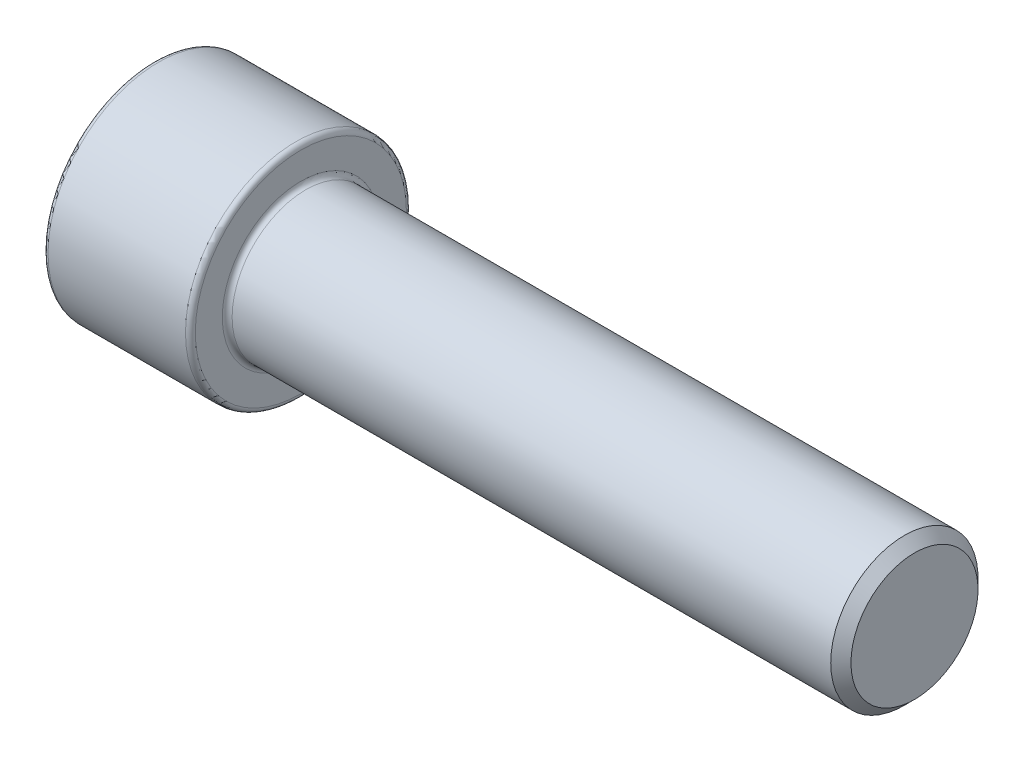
ISO-10303-21;
HEADER;
FILE_DESCRIPTION(('STEP AP214'),'2;1');
FILE_NAME('part.step','',(''),(''),'','','');
FILE_SCHEMA(('AUTOMOTIVE_DESIGN { 1 0 10303 214 1 1 1 1 }'));
ENDSEC;
DATA;
#1=APPLICATION_CONTEXT('core data for automotive mechanical design processes');
#2=APPLICATION_PROTOCOL_DEFINITION('international standard','automotive_design',2000,#1);
#3=PRODUCT_CONTEXT('',#1,'mechanical');
#4=PRODUCT('Part','Part','',(#3));
#5=PRODUCT_RELATED_PRODUCT_CATEGORY('part','',(#4));
#6=PRODUCT_DEFINITION_FORMATION('','',#4);
#7=PRODUCT_DEFINITION_CONTEXT('part definition',#1,'design');
#8=PRODUCT_DEFINITION('design','',#6,#7);
#9=PRODUCT_DEFINITION_SHAPE('','',#8);
#10=(LENGTH_UNIT() NAMED_UNIT(*) SI_UNIT(.MILLI.,.METRE.));
#11=(NAMED_UNIT(*) PLANE_ANGLE_UNIT() SI_UNIT($,.RADIAN.));
#12=(NAMED_UNIT(*) SI_UNIT($,.STERADIAN.) SOLID_ANGLE_UNIT());
#13=UNCERTAINTY_MEASURE_WITH_UNIT(LENGTH_MEASURE(1.E-05),#10,'distance_accuracy_value','');
#14=(GEOMETRIC_REPRESENTATION_CONTEXT(3) GLOBAL_UNCERTAINTY_ASSIGNED_CONTEXT((#13)) GLOBAL_UNIT_ASSIGNED_CONTEXT((#10,
#11,#12)) REPRESENTATION_CONTEXT('',''));
#15=CARTESIAN_POINT('',(0.,0.,0.));
#16=DIRECTION('',(0.,0.,1.));
#17=DIRECTION('',(1.,0.,0.));
#18=AXIS2_PLACEMENT_3D('',#15,#16,#17);
#19=CARTESIAN_POINT('',(12.,10.9696551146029,0.));
#20=DIRECTION('',(1.,0.,0.));
#21=DIRECTION('',(0.,0.,-1.));
#22=AXIS2_PLACEMENT_3D('',#19,#20,#21);
#23=PLANE('',#22);
#24=CARTESIAN_POINT('',(12.,0.,0.));
#25=DIRECTION('',(1.,0.,0.));
#26=DIRECTION('',(0.,0.,-1.));
#27=AXIS2_PLACEMENT_3D('',#24,#25,#26);
#28=CIRCLE('',#27,9.5);
#29=CARTESIAN_POINT('',(12.,0.,-9.5));
#30=VERTEX_POINT('',#29);
#31=CARTESIAN_POINT('',(12.,-8.22724133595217,-4.75));
#32=VERTEX_POINT('',#31);
#33=EDGE_CURVE('E171',#30,#32,#28,.F.);
#34=ORIENTED_EDGE('',*,*,#33,.F.);
#35=DIRECTION('',(0.,1.,0.));
#36=VECTOR('',#35,1.);
#37=CARTESIAN_POINT('',(12.,-5.48482755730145,-9.5));
#38=LINE('',#37,#36);
#39=CARTESIAN_POINT('',(12.,-5.48482755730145,-9.5));
#40=VERTEX_POINT('',#39);
#41=EDGE_CURVE('E204',#40,#30,#38,.T.);
#42=ORIENTED_EDGE('',*,*,#41,.F.);
#43=DIRECTION('',(0.,0.5,-0.866025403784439));
#44=VECTOR('',#43,1.);
#45=CARTESIAN_POINT('',(12.,-10.9696551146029,0.));
#46=LINE('',#45,#44);
#47=EDGE_CURVE('E196',#32,#40,#46,.T.);
#48=ORIENTED_EDGE('',*,*,#47,.F.);
#49=EDGE_LOOP('',(#34,#42,#48));
#50=FACE_BOUND('',#49,.T.);
#51=ADVANCED_FACE('F44',(#50),#23,.F.);
#52=CARTESIAN_POINT('',(12.,-8.22724133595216,4.75));
#53=VERTEX_POINT('',#52);
#54=EDGE_CURVE('E299',#32,#53,#28,.F.);
#55=ORIENTED_EDGE('',*,*,#54,.F.);
#56=CARTESIAN_POINT('',(12.,-10.9696551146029,0.));
#57=VERTEX_POINT('',#56);
#58=EDGE_CURVE('E197',#57,#32,#46,.T.);
#59=ORIENTED_EDGE('',*,*,#58,.F.);
#60=DIRECTION('',(0.,-0.5,-0.866025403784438));
#61=VECTOR('',#60,1.);
#62=CARTESIAN_POINT('',(12.,-5.48482755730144,9.5));
#63=LINE('',#62,#61);
#64=EDGE_CURVE('E191',#53,#57,#63,.T.);
#65=ORIENTED_EDGE('',*,*,#64,.F.);
#66=EDGE_LOOP('',(#55,#59,#65));
#67=FACE_BOUND('',#66,.T.);
#68=ADVANCED_FACE('F139',(#67),#23,.F.);
#69=CARTESIAN_POINT('',(12.,0.,9.5));
#70=VERTEX_POINT('',#69);
#71=EDGE_CURVE('E297',#53,#70,#28,.F.);
#72=ORIENTED_EDGE('',*,*,#71,.F.);
#73=CARTESIAN_POINT('',(12.,-5.48482755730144,9.5));
#74=VERTEX_POINT('',#73);
#75=EDGE_CURVE('E193',#74,#53,#63,.T.);
#76=ORIENTED_EDGE('',*,*,#75,.F.);
#77=DIRECTION('',(0.,-1.,0.));
#78=VECTOR('',#77,1.);
#79=CARTESIAN_POINT('',(12.,5.48482755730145,9.5));
#80=LINE('',#79,#78);
#81=EDGE_CURVE('E188',#70,#74,#80,.T.);
#82=ORIENTED_EDGE('',*,*,#81,.F.);
#83=EDGE_LOOP('',(#72,#76,#82));
#84=FACE_BOUND('',#83,.T.);
#85=ADVANCED_FACE('F144',(#84),#23,.F.);
#86=CARTESIAN_POINT('',(12.,8.22724133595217,4.75));
#87=VERTEX_POINT('',#86);
#88=EDGE_CURVE('E305',#70,#87,#28,.F.);
#89=ORIENTED_EDGE('',*,*,#88,.F.);
#90=CARTESIAN_POINT('',(12.,5.48482755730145,9.5));
#91=VERTEX_POINT('',#90);
#92=EDGE_CURVE('E192',#91,#70,#80,.T.);
#93=ORIENTED_EDGE('',*,*,#92,.F.);
#94=DIRECTION('',(0.,-0.5,0.866025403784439));
#95=VECTOR('',#94,1.);
#96=CARTESIAN_POINT('',(12.,10.9696551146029,0.));
#97=LINE('',#96,#95);
#98=EDGE_CURVE('E184',#87,#91,#97,.T.);
#99=ORIENTED_EDGE('',*,*,#98,.F.);
#100=EDGE_LOOP('',(#89,#93,#99));
#101=FACE_BOUND('',#100,.T.);
#102=ADVANCED_FACE('F156',(#101),#23,.F.);
#103=CARTESIAN_POINT('',(12.,8.22724133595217,-4.75));
#104=VERTEX_POINT('',#103);
#105=EDGE_CURVE('E58',#87,#104,#28,.F.);
#106=ORIENTED_EDGE('',*,*,#105,.F.);
#107=CARTESIAN_POINT('',(12.,10.9696551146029,0.));
#108=VERTEX_POINT('',#107);
#109=EDGE_CURVE('E176',#108,#87,#97,.T.);
#110=ORIENTED_EDGE('',*,*,#109,.F.);
#111=DIRECTION('',(0.,0.5,0.866025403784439));
#112=VECTOR('',#111,1.);
#113=CARTESIAN_POINT('',(12.,5.48482755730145,-9.5));
#114=LINE('',#113,#112);
#115=EDGE_CURVE('E173',#104,#108,#114,.T.);
#116=ORIENTED_EDGE('',*,*,#115,.F.);
#117=EDGE_LOOP('',(#106,#110,#116));
#118=FACE_BOUND('',#117,.T.);
#119=ADVANCED_FACE('F148',(#118),#23,.F.);
#120=EDGE_CURVE('E161',#104,#30,#28,.F.);
#121=ORIENTED_EDGE('',*,*,#120,.F.);
#122=CARTESIAN_POINT('',(12.,5.48482755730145,-9.5));
#123=VERTEX_POINT('',#122);
#124=EDGE_CURVE('E168',#123,#104,#114,.T.);
#125=ORIENTED_EDGE('',*,*,#124,.F.);
#126=EDGE_CURVE('E170',#30,#123,#38,.T.);
#127=ORIENTED_EDGE('',*,*,#126,.F.);
#128=EDGE_LOOP('',(#121,#125,#127));
#129=FACE_BOUND('',#128,.T.);
#130=ADVANCED_FACE('F136',(#129),#23,.F.);
#131=CARTESIAN_POINT('',(0.,0.,0.));
#132=DIRECTION('',(1.,0.,0.));
#133=DIRECTION('',(0.,0.,-1.));
#134=AXIS2_PLACEMENT_3D('',#131,#132,#133);
#135=PLANE('',#134);
#136=CARTESIAN_POINT('',(0.,0.,0.));
#137=DIRECTION('',(1.,0.,0.));
#138=DIRECTION('',(0.,0.,-1.));
#139=AXIS2_PLACEMENT_3D('',#136,#137,#138);
#140=CIRCLE('',#139,17.2);
#141=CARTESIAN_POINT('',(0.,0.,-17.2));
#142=VERTEX_POINT('',#141);
#143=EDGE_CURVE('E52',#142,#142,#140,.F.);
#144=ORIENTED_EDGE('',*,*,#143,.T.);
#145=EDGE_LOOP('',(#144));
#146=FACE_BOUND('',#145,.T.);
#147=DIRECTION('',(0.,0.5,0.866025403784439));
#148=VECTOR('',#147,1.);
#149=CARTESIAN_POINT('',(0.,5.48482755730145,-9.5));
#150=LINE('',#149,#148);
#151=CARTESIAN_POINT('',(0.,5.48482755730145,-9.5));
#152=VERTEX_POINT('',#151);
#153=CARTESIAN_POINT('',(0.,10.9696551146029,0.));
#154=VERTEX_POINT('',#153);
#155=EDGE_CURVE('E201',#152,#154,#150,.T.);
#156=ORIENTED_EDGE('',*,*,#155,.T.);
#157=DIRECTION('',(0.,-0.5,0.866025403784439));
#158=VECTOR('',#157,1.);
#159=CARTESIAN_POINT('',(0.,10.9696551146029,0.));
#160=LINE('',#159,#158);
#161=CARTESIAN_POINT('',(0.,5.48482755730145,9.5));
#162=VERTEX_POINT('',#161);
#163=EDGE_CURVE('E207',#154,#162,#160,.T.);
#164=ORIENTED_EDGE('',*,*,#163,.T.);
#165=DIRECTION('',(0.,-1.,0.));
#166=VECTOR('',#165,1.);
#167=CARTESIAN_POINT('',(0.,5.48482755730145,9.5));
#168=LINE('',#167,#166);
#169=CARTESIAN_POINT('',(0.,-5.48482755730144,9.5));
#170=VERTEX_POINT('',#169);
#171=EDGE_CURVE('E206',#162,#170,#168,.T.);
#172=ORIENTED_EDGE('',*,*,#171,.T.);
#173=DIRECTION('',(0.,-0.5,-0.866025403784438));
#174=VECTOR('',#173,1.);
#175=CARTESIAN_POINT('',(0.,-5.48482755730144,9.5));
#176=LINE('',#175,#174);
#177=CARTESIAN_POINT('',(0.,-10.9696551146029,0.));
#178=VERTEX_POINT('',#177);
#179=EDGE_CURVE('E208',#170,#178,#176,.T.);
#180=ORIENTED_EDGE('',*,*,#179,.T.);
#181=DIRECTION('',(0.,0.5,-0.866025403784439));
#182=VECTOR('',#181,1.);
#183=CARTESIAN_POINT('',(0.,-10.9696551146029,0.));
#184=LINE('',#183,#182);
#185=CARTESIAN_POINT('',(0.,-5.48482755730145,-9.5));
#186=VERTEX_POINT('',#185);
#187=EDGE_CURVE('E214',#178,#186,#184,.T.);
#188=ORIENTED_EDGE('',*,*,#187,.T.);
#189=DIRECTION('',(0.,1.,0.));
#190=VECTOR('',#189,1.);
#191=CARTESIAN_POINT('',(0.,-5.48482755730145,-9.5));
#192=LINE('',#191,#190);
#193=EDGE_CURVE('E66',#186,#152,#192,.T.);
#194=ORIENTED_EDGE('',*,*,#193,.T.);
#195=EDGE_LOOP('',(#156,#164,#172,#180,#188,#194));
#196=FACE_BOUND('',#195,.T.);
#197=ADVANCED_FACE('F146',(#146,#196),#135,.F.);
#198=CARTESIAN_POINT('',(24.,0.,0.));
#199=DIRECTION('',(1.,0.,0.));
#200=DIRECTION('',(0.,0.,-1.));
#201=AXIS2_PLACEMENT_3D('',#198,#199,#200);
#202=PLANE('',#201);
#203=CARTESIAN_POINT('',(24.,0.,0.));
#204=DIRECTION('',(1.,0.,0.));
#205=DIRECTION('',(0.,0.,-1.));
#206=AXIS2_PLACEMENT_3D('',#203,#204,#205);
#207=CIRCLE('',#206,17.2);
#208=CARTESIAN_POINT('',(24.,0.,-17.2));
#209=VERTEX_POINT('',#208);
#210=EDGE_CURVE('E238',#209,#209,#207,.T.);
#211=ORIENTED_EDGE('',*,*,#210,.T.);
#212=EDGE_LOOP('',(#211));
#213=FACE_BOUND('',#212,.T.);
#214=CARTESIAN_POINT('',(24.,0.,0.));
#215=DIRECTION('',(1.,0.,0.));
#216=DIRECTION('',(0.,0.,-1.));
#217=AXIS2_PLACEMENT_3D('',#214,#215,#216);
#218=CIRCLE('',#217,12.8);
#219=CARTESIAN_POINT('',(24.,0.,-12.8));
#220=VERTEX_POINT('',#219);
#221=EDGE_CURVE('E232',#220,#220,#218,.F.);
#222=ORIENTED_EDGE('',*,*,#221,.T.);
#223=EDGE_LOOP('',(#222));
#224=FACE_BOUND('',#223,.T.);
#225=ADVANCED_FACE('F157',(#213,#224),#202,.T.);
#226=CARTESIAN_POINT('',(24.,0.,0.));
#227=DIRECTION('',(-1.,0.,0.));
#228=DIRECTION('',(0.,0.,1.));
#229=AXIS2_PLACEMENT_3D('',#226,#227,#228);
#230=CYLINDRICAL_SURFACE('',#229,18.);
#231=CARTESIAN_POINT('',(23.2,0.,0.));
#232=DIRECTION('',(1.,0.,0.));
#233=DIRECTION('',(0.,0.,-1.));
#234=AXIS2_PLACEMENT_3D('',#231,#232,#233);
#235=CIRCLE('',#234,18.);
#236=CARTESIAN_POINT('',(23.2,0.,-18.));
#237=VERTEX_POINT('',#236);
#238=EDGE_CURVE('E242',#237,#237,#235,.F.);
#239=ORIENTED_EDGE('',*,*,#238,.T.);
#240=EDGE_LOOP('',(#239));
#241=FACE_BOUND('',#240,.T.);
#242=CARTESIAN_POINT('',(0.799999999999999,0.,0.));
#243=DIRECTION('',(1.,0.,0.));
#244=DIRECTION('',(0.,0.,-1.));
#245=AXIS2_PLACEMENT_3D('',#242,#243,#244);
#246=CIRCLE('',#245,18.);
#247=CARTESIAN_POINT('',(0.799999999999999,0.,-18.));
#248=VERTEX_POINT('',#247);
#249=EDGE_CURVE('E241',#248,#248,#246,.T.);
#250=ORIENTED_EDGE('',*,*,#249,.T.);
#251=EDGE_LOOP('',(#250));
#252=FACE_BOUND('',#251,.T.);
#253=ADVANCED_FACE('F254',(#241,#252),#230,.T.);
#254=CARTESIAN_POINT('',(124.,0.,0.));
#255=DIRECTION('',(-1.,0.,0.));
#256=DIRECTION('',(0.,0.,1.));
#257=AXIS2_PLACEMENT_3D('',#254,#255,#256);
#258=PLANE('',#257);
#259=CARTESIAN_POINT('',(124.,0.,0.));
#260=DIRECTION('',(-1.,0.,0.));
#261=DIRECTION('',(0.,0.,1.));
#262=AXIS2_PLACEMENT_3D('',#259,#260,#261);
#263=CIRCLE('',#262,10.352);
#264=CARTESIAN_POINT('',(124.,0.,10.352));
#265=VERTEX_POINT('',#264);
#266=EDGE_CURVE('E169',#265,#265,#263,.T.);
#267=ORIENTED_EDGE('',*,*,#266,.F.);
#268=EDGE_LOOP('',(#267));
#269=FACE_BOUND('',#268,.T.);
#270=ADVANCED_FACE('F253',(#269),#258,.F.);
#271=CARTESIAN_POINT('',(124.,0.,0.));
#272=DIRECTION('',(-1.,0.,0.));
#273=DIRECTION('',(0.,0.,1.));
#274=AXIS2_PLACEMENT_3D('',#271,#272,#273);
#275=CONICAL_SURFACE('',#274,10.352,0.785398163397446);
#276=CARTESIAN_POINT('',(122.352,0.,0.));
#277=DIRECTION('',(-1.,0.,0.));
#278=DIRECTION('',(0.,0.,1.));
#279=AXIS2_PLACEMENT_3D('',#276,#277,#278);
#280=CIRCLE('',#279,12.);
#281=CARTESIAN_POINT('',(122.352,0.,12.));
#282=VERTEX_POINT('',#281);
#283=EDGE_CURVE('E229',#282,#282,#280,.T.);
#284=ORIENTED_EDGE('',*,*,#283,.F.);
#285=EDGE_LOOP('',(#284));
#286=FACE_BOUND('',#285,.T.);
#287=ORIENTED_EDGE('',*,*,#266,.T.);
#288=EDGE_LOOP('',(#287));
#289=FACE_BOUND('',#288,.T.);
#290=ADVANCED_FACE('F261',(#286,#289),#275,.T.);
#291=CARTESIAN_POINT('',(0.,0.,0.));
#292=DIRECTION('',(-1.,0.,0.));
#293=DIRECTION('',(0.,0.,1.));
#294=AXIS2_PLACEMENT_3D('',#291,#292,#293);
#295=CYLINDRICAL_SURFACE('',#294,12.);
#296=CARTESIAN_POINT('',(24.8,0.,0.));
#297=DIRECTION('',(1.,0.,0.));
#298=DIRECTION('',(0.,0.,-1.));
#299=AXIS2_PLACEMENT_3D('',#296,#297,#298);
#300=CIRCLE('',#299,12.);
#301=CARTESIAN_POINT('',(24.8,0.,-12.));
#302=VERTEX_POINT('',#301);
#303=EDGE_CURVE('E11',#302,#302,#300,.T.);
#304=ORIENTED_EDGE('',*,*,#303,.T.);
#305=EDGE_LOOP('',(#304));
#306=FACE_BOUND('',#305,.T.);
#307=ORIENTED_EDGE('',*,*,#283,.T.);
#308=EDGE_LOOP('',(#307));
#309=FACE_BOUND('',#308,.T.);
#310=ADVANCED_FACE('F268',(#306,#309),#295,.T.);
#311=CARTESIAN_POINT('',(12.,5.48482755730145,-9.5));
#312=DIRECTION('',(0.,-0.866025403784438,0.5));
#313=DIRECTION('',(0.,-0.5,-0.866025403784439));
#314=AXIS2_PLACEMENT_3D('',#311,#312,#313);
#315=PLANE('',#314);
#316=ORIENTED_EDGE('',*,*,#124,.T.);
#317=ORIENTED_EDGE('',*,*,#115,.T.);
#318=DIRECTION('',(-1.,0.,0.));
#319=VECTOR('',#318,1.);
#320=CARTESIAN_POINT('',(12.,10.9696551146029,0.));
#321=LINE('',#320,#319);
#322=EDGE_CURVE('E226',#108,#154,#321,.T.);
#323=ORIENTED_EDGE('',*,*,#322,.T.);
#324=ORIENTED_EDGE('',*,*,#155,.F.);
#325=DIRECTION('',(-1.,0.,0.));
#326=VECTOR('',#325,1.);
#327=CARTESIAN_POINT('',(12.,5.48482755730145,-9.5));
#328=LINE('',#327,#326);
#329=EDGE_CURVE('E183',#123,#152,#328,.T.);
#330=ORIENTED_EDGE('',*,*,#329,.F.);
#331=EDGE_LOOP('',(#316,#317,#323,#324,#330));
#332=FACE_BOUND('',#331,.T.);
#333=ADVANCED_FACE('F185',(#332),#315,.T.);
#334=CARTESIAN_POINT('',(12.,10.9696551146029,0.));
#335=DIRECTION('',(0.,-0.866025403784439,-0.5));
#336=DIRECTION('',(0.,0.5,-0.866025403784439));
#337=AXIS2_PLACEMENT_3D('',#334,#335,#336);
#338=PLANE('',#337);
#339=ORIENTED_EDGE('',*,*,#109,.T.);
#340=ORIENTED_EDGE('',*,*,#98,.T.);
#341=DIRECTION('',(-1.,0.,0.));
#342=VECTOR('',#341,1.);
#343=CARTESIAN_POINT('',(12.,5.48482755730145,9.5));
#344=LINE('',#343,#342);
#345=EDGE_CURVE('E223',#91,#162,#344,.T.);
#346=ORIENTED_EDGE('',*,*,#345,.T.);
#347=ORIENTED_EDGE('',*,*,#163,.F.);
#348=ORIENTED_EDGE('',*,*,#322,.F.);
#349=EDGE_LOOP('',(#339,#340,#346,#347,#348));
#350=FACE_BOUND('',#349,.T.);
#351=ADVANCED_FACE('F277',(#350),#338,.T.);
#352=CARTESIAN_POINT('',(12.,5.48482755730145,9.5));
#353=DIRECTION('',(0.,0.,-1.));
#354=DIRECTION('',(-1.,0.,0.));
#355=AXIS2_PLACEMENT_3D('',#352,#353,#354);
#356=PLANE('',#355);
#357=ORIENTED_EDGE('',*,*,#92,.T.);
#358=ORIENTED_EDGE('',*,*,#81,.T.);
#359=DIRECTION('',(-1.,0.,0.));
#360=VECTOR('',#359,1.);
#361=CARTESIAN_POINT('',(12.,-5.48482755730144,9.5));
#362=LINE('',#361,#360);
#363=EDGE_CURVE('E224',#74,#170,#362,.T.);
#364=ORIENTED_EDGE('',*,*,#363,.T.);
#365=ORIENTED_EDGE('',*,*,#171,.F.);
#366=ORIENTED_EDGE('',*,*,#345,.F.);
#367=EDGE_LOOP('',(#357,#358,#364,#365,#366));
#368=FACE_BOUND('',#367,.T.);
#369=ADVANCED_FACE('F276',(#368),#356,.T.);
#370=CARTESIAN_POINT('',(12.,-5.48482755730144,9.5));
#371=DIRECTION('',(0.,0.866025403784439,-0.5));
#372=DIRECTION('',(0.,0.5,0.866025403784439));
#373=AXIS2_PLACEMENT_3D('',#370,#371,#372);
#374=PLANE('',#373);
#375=ORIENTED_EDGE('',*,*,#75,.T.);
#376=ORIENTED_EDGE('',*,*,#64,.T.);
#377=DIRECTION('',(-1.,0.,0.));
#378=VECTOR('',#377,1.);
#379=CARTESIAN_POINT('',(12.,-10.9696551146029,0.));
#380=LINE('',#379,#378);
#381=EDGE_CURVE('E217',#57,#178,#380,.T.);
#382=ORIENTED_EDGE('',*,*,#381,.T.);
#383=ORIENTED_EDGE('',*,*,#179,.F.);
#384=ORIENTED_EDGE('',*,*,#363,.F.);
#385=EDGE_LOOP('',(#375,#376,#382,#383,#384));
#386=FACE_BOUND('',#385,.T.);
#387=ADVANCED_FACE('F281',(#386),#374,.T.);
#388=CARTESIAN_POINT('',(12.,-10.9696551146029,0.));
#389=DIRECTION('',(0.,0.866025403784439,0.5));
#390=DIRECTION('',(0.,-0.5,0.866025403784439));
#391=AXIS2_PLACEMENT_3D('',#388,#389,#390);
#392=PLANE('',#391);
#393=ORIENTED_EDGE('',*,*,#58,.T.);
#394=ORIENTED_EDGE('',*,*,#47,.T.);
#395=DIRECTION('',(-1.,0.,0.));
#396=VECTOR('',#395,1.);
#397=CARTESIAN_POINT('',(12.,-5.48482755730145,-9.5));
#398=LINE('',#397,#396);
#399=EDGE_CURVE('E218',#40,#186,#398,.T.);
#400=ORIENTED_EDGE('',*,*,#399,.T.);
#401=ORIENTED_EDGE('',*,*,#187,.F.);
#402=ORIENTED_EDGE('',*,*,#381,.F.);
#403=EDGE_LOOP('',(#393,#394,#400,#401,#402));
#404=FACE_BOUND('',#403,.T.);
#405=ADVANCED_FACE('F289',(#404),#392,.T.);
#406=CARTESIAN_POINT('',(12.,-5.48482755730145,-9.5));
#407=DIRECTION('',(0.,0.,1.));
#408=DIRECTION('',(0.,-1.,0.));
#409=AXIS2_PLACEMENT_3D('',#406,#407,#408);
#410=PLANE('',#409);
#411=ORIENTED_EDGE('',*,*,#41,.T.);
#412=ORIENTED_EDGE('',*,*,#126,.T.);
#413=ORIENTED_EDGE('',*,*,#329,.T.);
#414=ORIENTED_EDGE('',*,*,#193,.F.);
#415=ORIENTED_EDGE('',*,*,#399,.F.);
#416=EDGE_LOOP('',(#411,#412,#413,#414,#415));
#417=FACE_BOUND('',#416,.T.);
#418=ADVANCED_FACE('F133',(#417),#410,.T.);
#419=CARTESIAN_POINT('',(0.,0.,0.));
#420=DIRECTION('',(-1.,0.,0.));
#421=DIRECTION('',(0.,0.,1.));
#422=AXIS2_PLACEMENT_3D('',#419,#420,#421);
#423=CYLINDRICAL_SURFACE('',#422,9.5);
#424=CARTESIAN_POINT('',(13.6,0.,0.));
#425=DIRECTION('',(-1.,0.,0.));
#426=DIRECTION('',(0.,0.,1.));
#427=AXIS2_PLACEMENT_3D('',#424,#425,#426);
#428=CIRCLE('',#427,9.5);
#429=CARTESIAN_POINT('',(13.6,0.,9.5));
#430=VERTEX_POINT('',#429);
#431=EDGE_CURVE('E189',#430,#430,#428,.T.);
#432=ORIENTED_EDGE('',*,*,#431,.F.);
#433=EDGE_LOOP('',(#432));
#434=FACE_BOUND('',#433,.T.);
#435=ORIENTED_EDGE('',*,*,#33,.T.);
#436=ORIENTED_EDGE('',*,*,#54,.T.);
#437=ORIENTED_EDGE('',*,*,#71,.T.);
#438=ORIENTED_EDGE('',*,*,#88,.T.);
#439=ORIENTED_EDGE('',*,*,#105,.T.);
#440=ORIENTED_EDGE('',*,*,#120,.T.);
#441=EDGE_LOOP('',(#435,#436,#437,#438,#439,#440));
#442=FACE_BOUND('',#441,.T.);
#443=ADVANCED_FACE('F119',(#434,#442),#423,.F.);
#444=CARTESIAN_POINT('',(19.0848275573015,0.,0.));
#445=DIRECTION('',(-1.,0.,0.));
#446=DIRECTION('',(0.,0.,1.));
#447=AXIS2_PLACEMENT_3D('',#444,#445,#446);
#448=CONICAL_SURFACE('',#447,0.,1.04719755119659);
#449=ORIENTED_EDGE('',*,*,#431,.T.);
#450=EDGE_LOOP('',(#449));
#451=FACE_BOUND('',#450,.T.);
#452=CARTESIAN_POINT('',(19.0848275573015,0.,0.));
#453=VERTEX_POINT('',#452);
#454=VERTEX_LOOP('',#453);
#455=FACE_BOUND('',#454,.T.);
#456=ADVANCED_FACE('F120',(#451,#455),#448,.F.);
#457=CARTESIAN_POINT('',(23.2,0.,0.));
#458=DIRECTION('',(1.,0.,0.));
#459=DIRECTION('',(0.,0.,-1.));
#460=AXIS2_PLACEMENT_3D('',#457,#458,#459);
#461=TOROIDAL_SURFACE('',#460,17.2,0.8);
#462=ORIENTED_EDGE('',*,*,#238,.F.);
#463=EDGE_LOOP('',(#462));
#464=FACE_BOUND('',#463,.T.);
#465=ORIENTED_EDGE('',*,*,#210,.F.);
#466=EDGE_LOOP('',(#465));
#467=FACE_BOUND('',#466,.T.);
#468=ADVANCED_FACE('F118',(#464,#467),#461,.T.);
#469=CARTESIAN_POINT('',(0.799999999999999,0.,0.));
#470=DIRECTION('',(1.,0.,0.));
#471=DIRECTION('',(0.,0.,-1.));
#472=AXIS2_PLACEMENT_3D('',#469,#470,#471);
#473=TOROIDAL_SURFACE('',#472,17.2,0.8);
#474=ORIENTED_EDGE('',*,*,#143,.F.);
#475=EDGE_LOOP('',(#474));
#476=FACE_BOUND('',#475,.T.);
#477=ORIENTED_EDGE('',*,*,#249,.F.);
#478=EDGE_LOOP('',(#477));
#479=FACE_BOUND('',#478,.T.);
#480=ADVANCED_FACE('F130',(#476,#479),#473,.T.);
#481=CARTESIAN_POINT('',(24.8,0.,0.));
#482=DIRECTION('',(1.,0.,0.));
#483=DIRECTION('',(0.,0.,-1.));
#484=AXIS2_PLACEMENT_3D('',#481,#482,#483);
#485=TOROIDAL_SURFACE('',#484,12.8,0.8);
#486=ORIENTED_EDGE('',*,*,#303,.F.);
#487=EDGE_LOOP('',(#486));
#488=FACE_BOUND('',#487,.T.);
#489=ORIENTED_EDGE('',*,*,#221,.F.);
#490=EDGE_LOOP('',(#489));
#491=FACE_BOUND('',#490,.T.);
#492=ADVANCED_FACE('F50',(#488,#491),#485,.F.);
#493=CLOSED_SHELL('',(#51,#68,#85,#102,#119,#130,#197,#225,#253,#270,#290,#310,#333,#351,#369,
#387,#405,#418,#443,#456,#468,#480,#492));
#494=MANIFOLD_SOLID_BREP('B2',#493);
#495=ADVANCED_BREP_SHAPE_REPRESENTATION('',(#18,#494),#14);
#496=SHAPE_DEFINITION_REPRESENTATION(#9,#495);
ENDSEC;
END-ISO-10303-21;
